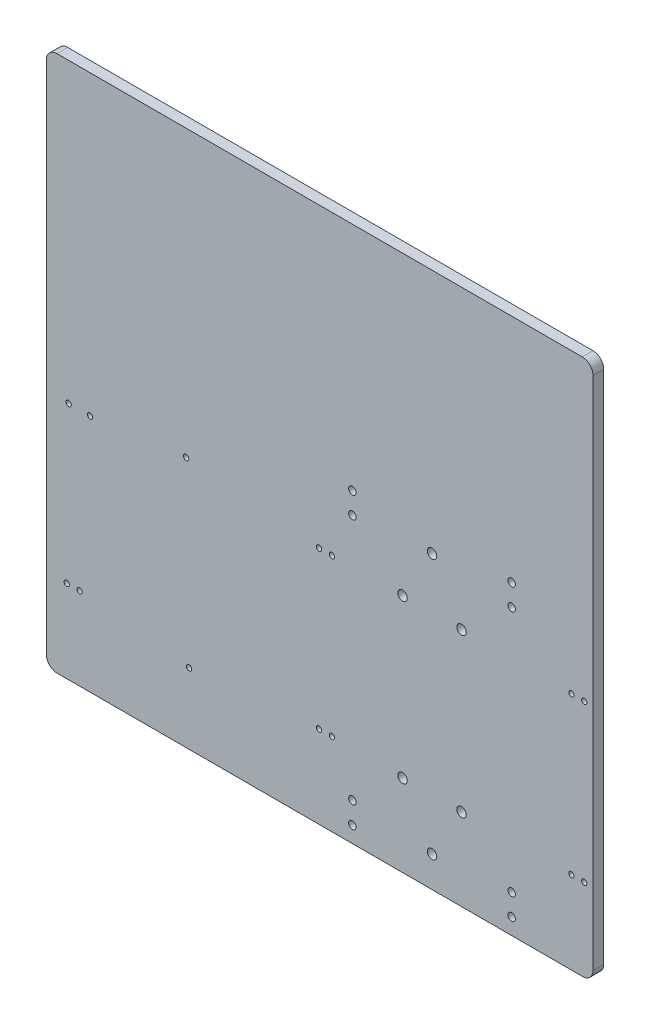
ISO-10303-21;
HEADER;
FILE_DESCRIPTION(('STEP AP214'),'2;1');
FILE_NAME('part.step','',(''),(''),'','','');
FILE_SCHEMA(('AUTOMOTIVE_DESIGN { 1 0 10303 214 1 1 1 1 }'));
ENDSEC;
DATA;
#1=APPLICATION_CONTEXT('core data for automotive mechanical design processes');
#2=APPLICATION_PROTOCOL_DEFINITION('international standard','automotive_design',2000,#1);
#3=PRODUCT_CONTEXT('',#1,'mechanical');
#4=PRODUCT('Part','Part','',(#3));
#5=PRODUCT_RELATED_PRODUCT_CATEGORY('part','',(#4));
#6=PRODUCT_DEFINITION_FORMATION('','',#4);
#7=PRODUCT_DEFINITION_CONTEXT('part definition',#1,'design');
#8=PRODUCT_DEFINITION('design','',#6,#7);
#9=PRODUCT_DEFINITION_SHAPE('','',#8);
#10=(LENGTH_UNIT() NAMED_UNIT(*) SI_UNIT(.MILLI.,.METRE.));
#11=(NAMED_UNIT(*) PLANE_ANGLE_UNIT() SI_UNIT($,.RADIAN.));
#12=(NAMED_UNIT(*) SI_UNIT($,.STERADIAN.) SOLID_ANGLE_UNIT());
#13=UNCERTAINTY_MEASURE_WITH_UNIT(LENGTH_MEASURE(1.E-05),#10,'distance_accuracy_value','');
#14=(GEOMETRIC_REPRESENTATION_CONTEXT(3) GLOBAL_UNCERTAINTY_ASSIGNED_CONTEXT((#13)) GLOBAL_UNIT_ASSIGNED_CONTEXT((#10,
#11,#12)) REPRESENTATION_CONTEXT('',''));
#15=CARTESIAN_POINT('',(0.,0.,0.));
#16=DIRECTION('',(0.,0.,1.));
#17=DIRECTION('',(1.,0.,0.));
#18=AXIS2_PLACEMENT_3D('',#15,#16,#17);
#19=CARTESIAN_POINT('',(50.8,0.,10.));
#20=DIRECTION('',(-1.,0.,0.));
#21=DIRECTION('',(0.,-1.,0.));
#22=AXIS2_PLACEMENT_3D('',#19,#20,#21);
#23=PLANE('',#22);
#24=DIRECTION('',(0.,1.,0.));
#25=VECTOR('',#24,1.);
#26=CARTESIAN_POINT('',(50.8,0.,0.));
#27=LINE('',#26,#25);
#28=CARTESIAN_POINT('',(50.8,9.525,0.));
#29=VERTEX_POINT('',#28);
#30=CARTESIAN_POINT('',(50.8,490.,0.));
#31=VERTEX_POINT('',#30);
#32=EDGE_CURVE('E254',#29,#31,#27,.T.);
#33=ORIENTED_EDGE('',*,*,#32,.T.);
#34=DIRECTION('',(0.,0.,-1.));
#35=VECTOR('',#34,1.);
#36=CARTESIAN_POINT('',(50.8,490.,10.));
#37=LINE('',#36,#35);
#38=CARTESIAN_POINT('',(50.8,490.,10.));
#39=VERTEX_POINT('',#38);
#40=EDGE_CURVE('E401',#31,#39,#37,.F.);
#41=ORIENTED_EDGE('',*,*,#40,.T.);
#42=DIRECTION('',(0.,1.,0.));
#43=VECTOR('',#42,1.);
#44=CARTESIAN_POINT('',(50.8,0.,10.));
#45=LINE('',#44,#43);
#46=CARTESIAN_POINT('',(50.8,9.525,10.));
#47=VERTEX_POINT('',#46);
#48=EDGE_CURVE('E383',#47,#39,#45,.T.);
#49=ORIENTED_EDGE('',*,*,#48,.F.);
#50=DIRECTION('',(0.,0.,-1.));
#51=VECTOR('',#50,1.);
#52=CARTESIAN_POINT('',(50.8,9.525,10.));
#53=LINE('',#52,#51);
#54=EDGE_CURVE('E121',#47,#29,#53,.T.);
#55=ORIENTED_EDGE('',*,*,#54,.T.);
#56=EDGE_LOOP('',(#33,#41,#49,#55));
#57=FACE_BOUND('',#56,.T.);
#58=ADVANCED_FACE('F43',(#57),#23,.F.);
#59=CARTESIAN_POINT('',(-1.11022302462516E-13,500.,10.));
#60=DIRECTION('',(0.,-1.,0.));
#61=DIRECTION('',(1.,0.,0.));
#62=AXIS2_PLACEMENT_3D('',#59,#60,#61);
#63=PLANE('',#62);
#64=DIRECTION('',(-1.,0.,0.));
#65=VECTOR('',#64,1.);
#66=CARTESIAN_POINT('',(-1.11022302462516E-13,500.,10.));
#67=LINE('',#66,#65);
#68=CARTESIAN_POINT('',(40.8,500.,10.));
#69=VERTEX_POINT('',#68);
#70=CARTESIAN_POINT('',(-448.725,500.,10.));
#71=VERTEX_POINT('',#70);
#72=EDGE_CURVE('E139',#69,#71,#67,.T.);
#73=ORIENTED_EDGE('',*,*,#72,.F.);
#74=DIRECTION('',(0.,0.,-1.));
#75=VECTOR('',#74,1.);
#76=CARTESIAN_POINT('',(40.8,500.,10.));
#77=LINE('',#76,#75);
#78=CARTESIAN_POINT('',(40.8,500.,0.));
#79=VERTEX_POINT('',#78);
#80=EDGE_CURVE('E388',#69,#79,#77,.T.);
#81=ORIENTED_EDGE('',*,*,#80,.T.);
#82=DIRECTION('',(-1.,0.,0.));
#83=VECTOR('',#82,1.);
#84=CARTESIAN_POINT('',(-1.11022302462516E-13,500.,0.));
#85=LINE('',#84,#83);
#86=CARTESIAN_POINT('',(-448.725,500.,0.));
#87=VERTEX_POINT('',#86);
#88=EDGE_CURVE('E258',#79,#87,#85,.T.);
#89=ORIENTED_EDGE('',*,*,#88,.T.);
#90=DIRECTION('',(0.,0.,-1.));
#91=VECTOR('',#90,1.);
#92=CARTESIAN_POINT('',(-448.725,500.,10.));
#93=LINE('',#92,#91);
#94=EDGE_CURVE('E120',#87,#71,#93,.F.);
#95=ORIENTED_EDGE('',*,*,#94,.T.);
#96=EDGE_LOOP('',(#73,#81,#89,#95));
#97=FACE_BOUND('',#96,.T.);
#98=ADVANCED_FACE('F434',(#97),#63,.F.);
#99=CARTESIAN_POINT('',(-458.725,0.,10.));
#100=DIRECTION('',(-1.,0.,0.));
#101=DIRECTION('',(0.,-1.,0.));
#102=AXIS2_PLACEMENT_3D('',#99,#100,#101);
#103=PLANE('',#102);
#104=DIRECTION('',(0.,1.,0.));
#105=VECTOR('',#104,1.);
#106=CARTESIAN_POINT('',(-458.725,0.,10.));
#107=LINE('',#106,#105);
#108=CARTESIAN_POINT('',(-458.725,9.99999999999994,10.));
#109=VERTEX_POINT('',#108);
#110=CARTESIAN_POINT('',(-458.725,490.,10.));
#111=VERTEX_POINT('',#110);
#112=EDGE_CURVE('E135',#109,#111,#107,.T.);
#113=ORIENTED_EDGE('',*,*,#112,.T.);
#114=DIRECTION('',(0.,0.,-1.));
#115=VECTOR('',#114,1.);
#116=CARTESIAN_POINT('',(-458.725,490.,0.));
#117=LINE('',#116,#115);
#118=CARTESIAN_POINT('',(-458.725,490.,0.));
#119=VERTEX_POINT('',#118);
#120=EDGE_CURVE('E52',#111,#119,#117,.T.);
#121=ORIENTED_EDGE('',*,*,#120,.T.);
#122=DIRECTION('',(0.,1.,0.));
#123=VECTOR('',#122,1.);
#124=CARTESIAN_POINT('',(-458.725,0.,0.));
#125=LINE('',#124,#123);
#126=CARTESIAN_POINT('',(-458.725,9.99999999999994,0.));
#127=VERTEX_POINT('',#126);
#128=EDGE_CURVE('E262',#127,#119,#125,.T.);
#129=ORIENTED_EDGE('',*,*,#128,.F.);
#130=DIRECTION('',(0.,0.,-1.));
#131=VECTOR('',#130,1.);
#132=CARTESIAN_POINT('',(-458.725,9.99999999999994,10.));
#133=LINE('',#132,#131);
#134=EDGE_CURVE('E411',#127,#109,#133,.F.);
#135=ORIENTED_EDGE('',*,*,#134,.T.);
#136=EDGE_LOOP('',(#113,#121,#129,#135));
#137=FACE_BOUND('',#136,.T.);
#138=ADVANCED_FACE('F419',(#137),#103,.T.);
#139=CARTESIAN_POINT('',(0.,0.,10.));
#140=DIRECTION('',(0.,-1.,0.));
#141=DIRECTION('',(1.,0.,0.));
#142=AXIS2_PLACEMENT_3D('',#139,#140,#141);
#143=PLANE('',#142);
#144=DIRECTION('',(-1.,0.,0.));
#145=VECTOR('',#144,1.);
#146=CARTESIAN_POINT('',(0.,0.,10.));
#147=LINE('',#146,#145);
#148=CARTESIAN_POINT('',(41.275,0.,10.));
#149=VERTEX_POINT('',#148);
#150=CARTESIAN_POINT('',(-448.725,0.,10.));
#151=VERTEX_POINT('',#150);
#152=EDGE_CURVE('E113',#149,#151,#147,.T.);
#153=ORIENTED_EDGE('',*,*,#152,.T.);
#154=DIRECTION('',(0.,0.,-1.));
#155=VECTOR('',#154,1.);
#156=CARTESIAN_POINT('',(-448.725,0.,10.));
#157=LINE('',#156,#155);
#158=CARTESIAN_POINT('',(-448.725,0.,0.));
#159=VERTEX_POINT('',#158);
#160=EDGE_CURVE('E11',#151,#159,#157,.T.);
#161=ORIENTED_EDGE('',*,*,#160,.T.);
#162=DIRECTION('',(-1.,0.,0.));
#163=VECTOR('',#162,1.);
#164=CARTESIAN_POINT('',(0.,0.,0.));
#165=LINE('',#164,#163);
#166=CARTESIAN_POINT('',(41.275,0.,0.));
#167=VERTEX_POINT('',#166);
#168=EDGE_CURVE('E116',#167,#159,#165,.T.);
#169=ORIENTED_EDGE('',*,*,#168,.F.);
#170=DIRECTION('',(0.,0.,-1.));
#171=VECTOR('',#170,1.);
#172=CARTESIAN_POINT('',(41.275,0.,10.));
#173=LINE('',#172,#171);
#174=EDGE_CURVE('E110',#149,#167,#173,.T.);
#175=ORIENTED_EDGE('',*,*,#174,.F.);
#176=EDGE_LOOP('',(#153,#161,#169,#175));
#177=FACE_BOUND('',#176,.T.);
#178=ADVANCED_FACE('F112',(#177),#143,.T.);
#179=CARTESIAN_POINT('',(-173.399999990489,15.000000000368,10.));
#180=DIRECTION('',(0.,0.,-1.));
#181=DIRECTION('',(-1.,0.,0.));
#182=AXIS2_PLACEMENT_3D('',#179,#180,#181);
#183=CYLINDRICAL_SURFACE('',#182,3.49999999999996);
#184=CARTESIAN_POINT('',(-173.399999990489,15.000000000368,10.));
#185=DIRECTION('',(0.,0.,1.));
#186=DIRECTION('',(1.,0.,0.));
#187=AXIS2_PLACEMENT_3D('',#184,#185,#186);
#188=CIRCLE('',#187,3.49999999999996);
#189=CARTESIAN_POINT('',(-169.899999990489,15.000000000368,10.));
#190=VERTEX_POINT('',#189);
#191=EDGE_CURVE('E246',#190,#190,#188,.T.);
#192=ORIENTED_EDGE('',*,*,#191,.T.);
#193=EDGE_LOOP('',(#192));
#194=FACE_BOUND('',#193,.T.);
#195=CARTESIAN_POINT('',(-173.399999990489,15.000000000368,0.));
#196=DIRECTION('',(0.,0.,1.));
#197=DIRECTION('',(1.,0.,0.));
#198=AXIS2_PLACEMENT_3D('',#195,#196,#197);
#199=CIRCLE('',#198,3.49999999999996);
#200=CARTESIAN_POINT('',(-169.899999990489,15.000000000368,0.));
#201=VERTEX_POINT('',#200);
#202=EDGE_CURVE('E375',#201,#201,#199,.T.);
#203=ORIENTED_EDGE('',*,*,#202,.F.);
#204=EDGE_LOOP('',(#203));
#205=FACE_BOUND('',#204,.T.);
#206=ADVANCED_FACE('F504',(#194,#205),#183,.F.);
#207=CARTESIAN_POINT('',(-71.7036934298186,223.62500000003,10.));
#208=DIRECTION('',(0.,0.,-1.));
#209=DIRECTION('',(-1.,0.,0.));
#210=AXIS2_PLACEMENT_3D('',#207,#208,#209);
#211=CYLINDRICAL_SURFACE('',#210,4.40054999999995);
#212=CARTESIAN_POINT('',(-71.7036934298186,223.62500000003,10.));
#213=DIRECTION('',(0.,0.,1.));
#214=DIRECTION('',(1.,0.,0.));
#215=AXIS2_PLACEMENT_3D('',#212,#213,#214);
#216=CIRCLE('',#215,4.40054999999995);
#217=CARTESIAN_POINT('',(-67.3031434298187,223.62500000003,10.));
#218=VERTEX_POINT('',#217);
#219=EDGE_CURVE('E242',#218,#218,#216,.T.);
#220=ORIENTED_EDGE('',*,*,#219,.T.);
#221=EDGE_LOOP('',(#220));
#222=FACE_BOUND('',#221,.T.);
#223=CARTESIAN_POINT('',(-71.7036934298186,223.62500000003,0.));
#224=DIRECTION('',(0.,0.,1.));
#225=DIRECTION('',(1.,0.,0.));
#226=AXIS2_PLACEMENT_3D('',#223,#224,#225);
#227=CIRCLE('',#226,4.40054999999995);
#228=CARTESIAN_POINT('',(-67.3031434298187,223.62500000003,0.));
#229=VERTEX_POINT('',#228);
#230=EDGE_CURVE('E371',#229,#229,#227,.T.);
#231=ORIENTED_EDGE('',*,*,#230,.F.);
#232=EDGE_LOOP('',(#231));
#233=FACE_BOUND('',#232,.T.);
#234=ADVANCED_FACE('F507',(#222,#233),#211,.F.);
#235=CARTESIAN_POINT('',(-99.1999999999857,271.250000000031,10.));
#236=DIRECTION('',(0.,0.,-1.));
#237=DIRECTION('',(-1.,0.,0.));
#238=AXIS2_PLACEMENT_3D('',#235,#236,#237);
#239=CYLINDRICAL_SURFACE('',#238,4.40055);
#240=CARTESIAN_POINT('',(-99.1999999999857,271.250000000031,10.));
#241=DIRECTION('',(0.,0.,1.));
#242=DIRECTION('',(1.,0.,0.));
#243=AXIS2_PLACEMENT_3D('',#240,#241,#242);
#244=CIRCLE('',#243,4.40055);
#245=CARTESIAN_POINT('',(-94.7994499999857,271.250000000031,10.));
#246=VERTEX_POINT('',#245);
#247=EDGE_CURVE('E238',#246,#246,#244,.T.);
#248=ORIENTED_EDGE('',*,*,#247,.T.);
#249=EDGE_LOOP('',(#248));
#250=FACE_BOUND('',#249,.T.);
#251=CARTESIAN_POINT('',(-99.1999999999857,271.250000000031,0.));
#252=DIRECTION('',(0.,0.,1.));
#253=DIRECTION('',(1.,0.,0.));
#254=AXIS2_PLACEMENT_3D('',#251,#252,#253);
#255=CIRCLE('',#254,4.40055);
#256=CARTESIAN_POINT('',(-94.7994499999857,271.250000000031,0.));
#257=VERTEX_POINT('',#256);
#258=EDGE_CURVE('E367',#257,#257,#255,.T.);
#259=ORIENTED_EDGE('',*,*,#258,.F.);
#260=EDGE_LOOP('',(#259));
#261=FACE_BOUND('',#260,.T.);
#262=ADVANCED_FACE('F511',(#250,#261),#239,.F.);
#263=CARTESIAN_POINT('',(-126.696306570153,223.625000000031,10.));
#264=DIRECTION('',(0.,0.,-1.));
#265=DIRECTION('',(-1.,0.,0.));
#266=AXIS2_PLACEMENT_3D('',#263,#264,#265);
#267=CYLINDRICAL_SURFACE('',#266,4.40054999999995);
#268=CARTESIAN_POINT('',(-126.696306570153,223.625000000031,10.));
#269=DIRECTION('',(0.,0.,1.));
#270=DIRECTION('',(1.,0.,0.));
#271=AXIS2_PLACEMENT_3D('',#268,#269,#270);
#272=CIRCLE('',#271,4.40054999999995);
#273=CARTESIAN_POINT('',(-122.295756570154,223.625000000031,10.));
#274=VERTEX_POINT('',#273);
#275=EDGE_CURVE('E234',#274,#274,#272,.T.);
#276=ORIENTED_EDGE('',*,*,#275,.T.);
#277=EDGE_LOOP('',(#276));
#278=FACE_BOUND('',#277,.T.);
#279=CARTESIAN_POINT('',(-126.696306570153,223.625000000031,0.));
#280=DIRECTION('',(0.,0.,1.));
#281=DIRECTION('',(1.,0.,0.));
#282=AXIS2_PLACEMENT_3D('',#279,#280,#281);
#283=CIRCLE('',#282,4.40054999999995);
#284=CARTESIAN_POINT('',(-122.295756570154,223.625000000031,0.));
#285=VERTEX_POINT('',#284);
#286=EDGE_CURVE('E363',#285,#285,#283,.T.);
#287=ORIENTED_EDGE('',*,*,#286,.F.);
#288=EDGE_LOOP('',(#287));
#289=FACE_BOUND('',#288,.T.);
#290=ADVANCED_FACE('F515',(#278,#289),#267,.F.);
#291=CARTESIAN_POINT('',(-71.7036934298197,76.3750000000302,10.));
#292=DIRECTION('',(0.,0.,-1.));
#293=DIRECTION('',(-1.,0.,0.));
#294=AXIS2_PLACEMENT_3D('',#291,#292,#293);
#295=CYLINDRICAL_SURFACE('',#294,4.40054999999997);
#296=CARTESIAN_POINT('',(-71.7036934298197,76.3750000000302,10.));
#297=DIRECTION('',(0.,0.,1.));
#298=DIRECTION('',(1.,0.,0.));
#299=AXIS2_PLACEMENT_3D('',#296,#297,#298);
#300=CIRCLE('',#299,4.40054999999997);
#301=CARTESIAN_POINT('',(-67.3031434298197,76.3750000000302,10.));
#302=VERTEX_POINT('',#301);
#303=EDGE_CURVE('E230',#302,#302,#300,.T.);
#304=ORIENTED_EDGE('',*,*,#303,.T.);
#305=EDGE_LOOP('',(#304));
#306=FACE_BOUND('',#305,.T.);
#307=CARTESIAN_POINT('',(-71.7036934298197,76.3750000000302,0.));
#308=DIRECTION('',(0.,0.,1.));
#309=DIRECTION('',(1.,0.,0.));
#310=AXIS2_PLACEMENT_3D('',#307,#308,#309);
#311=CIRCLE('',#310,4.40054999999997);
#312=CARTESIAN_POINT('',(-67.3031434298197,76.3750000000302,0.));
#313=VERTEX_POINT('',#312);
#314=EDGE_CURVE('E359',#313,#313,#311,.T.);
#315=ORIENTED_EDGE('',*,*,#314,.F.);
#316=EDGE_LOOP('',(#315));
#317=FACE_BOUND('',#316,.T.);
#318=ADVANCED_FACE('F519',(#306,#317),#295,.F.);
#319=CARTESIAN_POINT('',(-99.1999999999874,28.7500000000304,10.));
#320=DIRECTION('',(0.,0.,-1.));
#321=DIRECTION('',(-1.,0.,0.));
#322=AXIS2_PLACEMENT_3D('',#319,#320,#321);
#323=CYLINDRICAL_SURFACE('',#322,4.40055);
#324=CARTESIAN_POINT('',(-99.1999999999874,28.7500000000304,10.));
#325=DIRECTION('',(0.,0.,1.));
#326=DIRECTION('',(1.,0.,0.));
#327=AXIS2_PLACEMENT_3D('',#324,#325,#326);
#328=CIRCLE('',#327,4.40055);
#329=CARTESIAN_POINT('',(-94.7994499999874,28.7500000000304,10.));
#330=VERTEX_POINT('',#329);
#331=EDGE_CURVE('E226',#330,#330,#328,.T.);
#332=ORIENTED_EDGE('',*,*,#331,.T.);
#333=EDGE_LOOP('',(#332));
#334=FACE_BOUND('',#333,.T.);
#335=CARTESIAN_POINT('',(-99.1999999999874,28.7500000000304,0.));
#336=DIRECTION('',(0.,0.,1.));
#337=DIRECTION('',(1.,0.,0.));
#338=AXIS2_PLACEMENT_3D('',#335,#336,#337);
#339=CIRCLE('',#338,4.40055);
#340=CARTESIAN_POINT('',(-94.7994499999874,28.7500000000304,0.));
#341=VERTEX_POINT('',#340);
#342=EDGE_CURVE('E355',#341,#341,#339,.T.);
#343=ORIENTED_EDGE('',*,*,#342,.F.);
#344=EDGE_LOOP('',(#343));
#345=FACE_BOUND('',#344,.T.);
#346=ADVANCED_FACE('F523',(#334,#345),#323,.F.);
#347=CARTESIAN_POINT('',(-126.696306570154,76.3750000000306,10.));
#348=DIRECTION('',(0.,0.,-1.));
#349=DIRECTION('',(-1.,0.,0.));
#350=AXIS2_PLACEMENT_3D('',#347,#348,#349);
#351=CYLINDRICAL_SURFACE('',#350,4.40054999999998);
#352=CARTESIAN_POINT('',(-126.696306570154,76.3750000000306,10.));
#353=DIRECTION('',(0.,0.,1.));
#354=DIRECTION('',(1.,0.,0.));
#355=AXIS2_PLACEMENT_3D('',#352,#353,#354);
#356=CIRCLE('',#355,4.40054999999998);
#357=CARTESIAN_POINT('',(-122.295756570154,76.3750000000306,10.));
#358=VERTEX_POINT('',#357);
#359=EDGE_CURVE('E222',#358,#358,#356,.T.);
#360=ORIENTED_EDGE('',*,*,#359,.T.);
#361=EDGE_LOOP('',(#360));
#362=FACE_BOUND('',#361,.T.);
#363=CARTESIAN_POINT('',(-126.696306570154,76.3750000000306,0.));
#364=DIRECTION('',(0.,0.,1.));
#365=DIRECTION('',(1.,0.,0.));
#366=AXIS2_PLACEMENT_3D('',#363,#364,#365);
#367=CIRCLE('',#366,4.40054999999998);
#368=CARTESIAN_POINT('',(-122.295756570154,76.3750000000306,0.));
#369=VERTEX_POINT('',#368);
#370=EDGE_CURVE('E351',#369,#369,#367,.T.);
#371=ORIENTED_EDGE('',*,*,#370,.F.);
#372=EDGE_LOOP('',(#371));
#373=FACE_BOUND('',#372,.T.);
#374=ADVANCED_FACE('F527',(#362,#373),#351,.F.);
#375=CARTESIAN_POINT('',(-25.0000000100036,15.000000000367,10.));
#376=DIRECTION('',(0.,0.,-1.));
#377=DIRECTION('',(-1.,0.,0.));
#378=AXIS2_PLACEMENT_3D('',#375,#376,#377);
#379=CYLINDRICAL_SURFACE('',#378,3.5);
#380=CARTESIAN_POINT('',(-25.0000000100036,15.000000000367,10.));
#381=DIRECTION('',(0.,0.,1.));
#382=DIRECTION('',(1.,0.,0.));
#383=AXIS2_PLACEMENT_3D('',#380,#381,#382);
#384=CIRCLE('',#383,3.5);
#385=CARTESIAN_POINT('',(-21.5000000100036,15.000000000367,10.));
#386=VERTEX_POINT('',#385);
#387=EDGE_CURVE('E218',#386,#386,#384,.T.);
#388=ORIENTED_EDGE('',*,*,#387,.T.);
#389=EDGE_LOOP('',(#388));
#390=FACE_BOUND('',#389,.T.);
#391=CARTESIAN_POINT('',(-25.0000000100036,15.000000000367,0.));
#392=DIRECTION('',(0.,0.,1.));
#393=DIRECTION('',(1.,0.,0.));
#394=AXIS2_PLACEMENT_3D('',#391,#392,#393);
#395=CIRCLE('',#394,3.5);
#396=CARTESIAN_POINT('',(-21.5000000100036,15.000000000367,0.));
#397=VERTEX_POINT('',#396);
#398=EDGE_CURVE('E347',#397,#397,#395,.T.);
#399=ORIENTED_EDGE('',*,*,#398,.F.);
#400=EDGE_LOOP('',(#399));
#401=FACE_BOUND('',#400,.T.);
#402=ADVANCED_FACE('F531',(#390,#401),#379,.F.);
#403=CARTESIAN_POINT('',(-25.0000000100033,35.000000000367,10.));
#404=DIRECTION('',(0.,0.,-1.));
#405=DIRECTION('',(-1.,0.,0.));
#406=AXIS2_PLACEMENT_3D('',#403,#404,#405);
#407=CYLINDRICAL_SURFACE('',#406,3.5);
#408=CARTESIAN_POINT('',(-25.0000000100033,35.000000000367,10.));
#409=DIRECTION('',(0.,0.,1.));
#410=DIRECTION('',(1.,0.,0.));
#411=AXIS2_PLACEMENT_3D('',#408,#409,#410);
#412=CIRCLE('',#411,3.5);
#413=CARTESIAN_POINT('',(-21.5000000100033,35.000000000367,10.));
#414=VERTEX_POINT('',#413);
#415=EDGE_CURVE('E214',#414,#414,#412,.T.);
#416=ORIENTED_EDGE('',*,*,#415,.T.);
#417=EDGE_LOOP('',(#416));
#418=FACE_BOUND('',#417,.T.);
#419=CARTESIAN_POINT('',(-25.0000000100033,35.000000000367,0.));
#420=DIRECTION('',(0.,0.,1.));
#421=DIRECTION('',(1.,0.,0.));
#422=AXIS2_PLACEMENT_3D('',#419,#420,#421);
#423=CIRCLE('',#422,3.5);
#424=CARTESIAN_POINT('',(-21.5000000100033,35.000000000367,0.));
#425=VERTEX_POINT('',#424);
#426=EDGE_CURVE('E343',#425,#425,#423,.T.);
#427=ORIENTED_EDGE('',*,*,#426,.F.);
#428=EDGE_LOOP('',(#427));
#429=FACE_BOUND('',#428,.T.);
#430=ADVANCED_FACE('F535',(#418,#429),#407,.F.);
#431=CARTESIAN_POINT('',(-173.399999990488,264.999999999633,10.));
#432=DIRECTION('',(0.,0.,-1.));
#433=DIRECTION('',(-1.,0.,0.));
#434=AXIS2_PLACEMENT_3D('',#431,#432,#433);
#435=CYLINDRICAL_SURFACE('',#434,3.49999999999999);
#436=CARTESIAN_POINT('',(-173.399999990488,264.999999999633,10.));
#437=DIRECTION('',(0.,0.,1.));
#438=DIRECTION('',(1.,0.,0.));
#439=AXIS2_PLACEMENT_3D('',#436,#437,#438);
#440=CIRCLE('',#439,3.49999999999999);
#441=CARTESIAN_POINT('',(-169.899999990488,264.999999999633,10.));
#442=VERTEX_POINT('',#441);
#443=EDGE_CURVE('E210',#442,#442,#440,.T.);
#444=ORIENTED_EDGE('',*,*,#443,.T.);
#445=EDGE_LOOP('',(#444));
#446=FACE_BOUND('',#445,.T.);
#447=CARTESIAN_POINT('',(-173.399999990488,264.999999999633,0.));
#448=DIRECTION('',(0.,0.,1.));
#449=DIRECTION('',(1.,0.,0.));
#450=AXIS2_PLACEMENT_3D('',#447,#448,#449);
#451=CIRCLE('',#450,3.49999999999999);
#452=CARTESIAN_POINT('',(-169.899999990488,264.999999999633,0.));
#453=VERTEX_POINT('',#452);
#454=EDGE_CURVE('E339',#453,#453,#451,.T.);
#455=ORIENTED_EDGE('',*,*,#454,.F.);
#456=EDGE_LOOP('',(#455));
#457=FACE_BOUND('',#456,.T.);
#458=ADVANCED_FACE('F539',(#446,#457),#435,.F.);
#459=CARTESIAN_POINT('',(-173.399999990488,284.999999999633,10.));
#460=DIRECTION('',(0.,0.,-1.));
#461=DIRECTION('',(-1.,0.,0.));
#462=AXIS2_PLACEMENT_3D('',#459,#460,#461);
#463=CYLINDRICAL_SURFACE('',#462,3.49999999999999);
#464=CARTESIAN_POINT('',(-173.399999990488,284.999999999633,10.));
#465=DIRECTION('',(0.,0.,1.));
#466=DIRECTION('',(1.,0.,0.));
#467=AXIS2_PLACEMENT_3D('',#464,#465,#466);
#468=CIRCLE('',#467,3.49999999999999);
#469=CARTESIAN_POINT('',(-169.899999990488,284.999999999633,10.));
#470=VERTEX_POINT('',#469);
#471=EDGE_CURVE('E206',#470,#470,#468,.T.);
#472=ORIENTED_EDGE('',*,*,#471,.T.);
#473=EDGE_LOOP('',(#472));
#474=FACE_BOUND('',#473,.T.);
#475=CARTESIAN_POINT('',(-173.399999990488,284.999999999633,0.));
#476=DIRECTION('',(0.,0.,1.));
#477=DIRECTION('',(1.,0.,0.));
#478=AXIS2_PLACEMENT_3D('',#475,#476,#477);
#479=CIRCLE('',#478,3.49999999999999);
#480=CARTESIAN_POINT('',(-169.899999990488,284.999999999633,0.));
#481=VERTEX_POINT('',#480);
#482=EDGE_CURVE('E335',#481,#481,#479,.T.);
#483=ORIENTED_EDGE('',*,*,#482,.F.);
#484=EDGE_LOOP('',(#483));
#485=FACE_BOUND('',#484,.T.);
#486=ADVANCED_FACE('F543',(#474,#485),#463,.F.);
#487=CARTESIAN_POINT('',(-437.93088623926,223.00000004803,10.));
#488=DIRECTION('',(0.,0.,-1.));
#489=DIRECTION('',(-1.,0.,0.));
#490=AXIS2_PLACEMENT_3D('',#487,#488,#489);
#491=CYLINDRICAL_SURFACE('',#490,2.48920000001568);
#492=CARTESIAN_POINT('',(-437.93088623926,223.00000004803,10.));
#493=DIRECTION('',(0.,0.,1.));
#494=DIRECTION('',(1.,0.,0.));
#495=AXIS2_PLACEMENT_3D('',#492,#493,#494);
#496=CIRCLE('',#495,2.48920000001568);
#497=CARTESIAN_POINT('',(-435.441686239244,223.00000004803,10.));
#498=VERTEX_POINT('',#497);
#499=EDGE_CURVE('E202',#498,#498,#496,.T.);
#500=ORIENTED_EDGE('',*,*,#499,.T.);
#501=EDGE_LOOP('',(#500));
#502=FACE_BOUND('',#501,.T.);
#503=CARTESIAN_POINT('',(-437.93088623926,223.00000004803,0.));
#504=DIRECTION('',(0.,0.,1.));
#505=DIRECTION('',(1.,0.,0.));
#506=AXIS2_PLACEMENT_3D('',#503,#504,#505);
#507=CIRCLE('',#506,2.48920000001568);
#508=CARTESIAN_POINT('',(-435.441686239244,223.00000004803,0.));
#509=VERTEX_POINT('',#508);
#510=EDGE_CURVE('E331',#509,#509,#507,.T.);
#511=ORIENTED_EDGE('',*,*,#510,.F.);
#512=EDGE_LOOP('',(#511));
#513=FACE_BOUND('',#512,.T.);
#514=ADVANCED_FACE('F547',(#502,#513),#491,.F.);
#515=CARTESIAN_POINT('',(-417.93088623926,223.00000004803,10.));
#516=DIRECTION('',(0.,0.,-1.));
#517=DIRECTION('',(-1.,0.,0.));
#518=AXIS2_PLACEMENT_3D('',#515,#516,#517);
#519=CYLINDRICAL_SURFACE('',#518,2.48920000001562);
#520=CARTESIAN_POINT('',(-417.93088623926,223.00000004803,10.));
#521=DIRECTION('',(0.,0.,1.));
#522=DIRECTION('',(1.,0.,0.));
#523=AXIS2_PLACEMENT_3D('',#520,#521,#522);
#524=CIRCLE('',#523,2.48920000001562);
#525=CARTESIAN_POINT('',(-415.441686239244,223.00000004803,10.));
#526=VERTEX_POINT('',#525);
#527=EDGE_CURVE('E198',#526,#526,#524,.T.);
#528=ORIENTED_EDGE('',*,*,#527,.T.);
#529=EDGE_LOOP('',(#528));
#530=FACE_BOUND('',#529,.T.);
#531=CARTESIAN_POINT('',(-417.93088623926,223.00000004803,0.));
#532=DIRECTION('',(0.,0.,1.));
#533=DIRECTION('',(1.,0.,0.));
#534=AXIS2_PLACEMENT_3D('',#531,#532,#533);
#535=CIRCLE('',#534,2.48920000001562);
#536=CARTESIAN_POINT('',(-415.441686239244,223.00000004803,0.));
#537=VERTEX_POINT('',#536);
#538=EDGE_CURVE('E327',#537,#537,#535,.T.);
#539=ORIENTED_EDGE('',*,*,#538,.F.);
#540=EDGE_LOOP('',(#539));
#541=FACE_BOUND('',#540,.T.);
#542=ADVANCED_FACE('F551',(#530,#541),#519,.F.);
#543=CARTESIAN_POINT('',(-439.725,76.9999999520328,10.));
#544=DIRECTION('',(0.,0.,-1.));
#545=DIRECTION('',(-1.,0.,0.));
#546=AXIS2_PLACEMENT_3D('',#543,#544,#545);
#547=CYLINDRICAL_SURFACE('',#546,2.48920000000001);
#548=CARTESIAN_POINT('',(-439.725,76.9999999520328,10.));
#549=DIRECTION('',(0.,0.,1.));
#550=DIRECTION('',(1.,0.,0.));
#551=AXIS2_PLACEMENT_3D('',#548,#549,#550);
#552=CIRCLE('',#551,2.48920000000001);
#553=CARTESIAN_POINT('',(-437.2358,76.9999999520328,10.));
#554=VERTEX_POINT('',#553);
#555=EDGE_CURVE('E194',#554,#554,#552,.T.);
#556=ORIENTED_EDGE('',*,*,#555,.T.);
#557=EDGE_LOOP('',(#556));
#558=FACE_BOUND('',#557,.T.);
#559=CARTESIAN_POINT('',(-439.725,76.9999999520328,0.));
#560=DIRECTION('',(0.,0.,1.));
#561=DIRECTION('',(1.,0.,0.));
#562=AXIS2_PLACEMENT_3D('',#559,#560,#561);
#563=CIRCLE('',#562,2.48920000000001);
#564=CARTESIAN_POINT('',(-437.2358,76.9999999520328,0.));
#565=VERTEX_POINT('',#564);
#566=EDGE_CURVE('E323',#565,#565,#563,.T.);
#567=ORIENTED_EDGE('',*,*,#566,.F.);
#568=EDGE_LOOP('',(#567));
#569=FACE_BOUND('',#568,.T.);
#570=ADVANCED_FACE('F555',(#558,#569),#547,.F.);
#571=CARTESIAN_POINT('',(-427.725,76.9999999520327,10.));
#572=DIRECTION('',(0.,0.,-1.));
#573=DIRECTION('',(-1.,0.,0.));
#574=AXIS2_PLACEMENT_3D('',#571,#572,#573);
#575=CYLINDRICAL_SURFACE('',#574,2.47649999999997);
#576=CARTESIAN_POINT('',(-427.725,76.9999999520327,10.));
#577=DIRECTION('',(0.,0.,1.));
#578=DIRECTION('',(1.,0.,0.));
#579=AXIS2_PLACEMENT_3D('',#576,#577,#578);
#580=CIRCLE('',#579,2.47649999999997);
#581=CARTESIAN_POINT('',(-425.2485,76.9999999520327,10.));
#582=VERTEX_POINT('',#581);
#583=EDGE_CURVE('E190',#582,#582,#580,.T.);
#584=ORIENTED_EDGE('',*,*,#583,.T.);
#585=EDGE_LOOP('',(#584));
#586=FACE_BOUND('',#585,.T.);
#587=CARTESIAN_POINT('',(-427.725,76.9999999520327,0.));
#588=DIRECTION('',(0.,0.,1.));
#589=DIRECTION('',(1.,0.,0.));
#590=AXIS2_PLACEMENT_3D('',#587,#588,#589);
#591=CIRCLE('',#590,2.47649999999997);
#592=CARTESIAN_POINT('',(-425.2485,76.9999999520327,0.));
#593=VERTEX_POINT('',#592);
#594=EDGE_CURVE('E319',#593,#593,#591,.T.);
#595=ORIENTED_EDGE('',*,*,#594,.F.);
#596=EDGE_LOOP('',(#595));
#597=FACE_BOUND('',#596,.T.);
#598=ADVANCED_FACE('F559',(#586,#597),#575,.F.);
#599=CARTESIAN_POINT('',(-204.50625,223.000000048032,10.));
#600=DIRECTION('',(0.,0.,-1.));
#601=DIRECTION('',(-1.,0.,0.));
#602=AXIS2_PLACEMENT_3D('',#599,#600,#601);
#603=CYLINDRICAL_SURFACE('',#602,2.47650000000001);
#604=CARTESIAN_POINT('',(-204.50625,223.000000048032,10.));
#605=DIRECTION('',(0.,0.,1.));
#606=DIRECTION('',(1.,0.,0.));
#607=AXIS2_PLACEMENT_3D('',#604,#605,#606);
#608=CIRCLE('',#607,2.47650000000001);
#609=CARTESIAN_POINT('',(-202.02975,223.000000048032,10.));
#610=VERTEX_POINT('',#609);
#611=EDGE_CURVE('E186',#610,#610,#608,.T.);
#612=ORIENTED_EDGE('',*,*,#611,.T.);
#613=EDGE_LOOP('',(#612));
#614=FACE_BOUND('',#613,.T.);
#615=CARTESIAN_POINT('',(-204.50625,223.000000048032,0.));
#616=DIRECTION('',(0.,0.,1.));
#617=DIRECTION('',(1.,0.,0.));
#618=AXIS2_PLACEMENT_3D('',#615,#616,#617);
#619=CIRCLE('',#618,2.47650000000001);
#620=CARTESIAN_POINT('',(-202.02975,223.000000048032,0.));
#621=VERTEX_POINT('',#620);
#622=EDGE_CURVE('E315',#621,#621,#619,.T.);
#623=ORIENTED_EDGE('',*,*,#622,.F.);
#624=EDGE_LOOP('',(#623));
#625=FACE_BOUND('',#624,.T.);
#626=ADVANCED_FACE('F563',(#614,#625),#603,.F.);
#627=CARTESIAN_POINT('',(-192.50625,223.000000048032,10.));
#628=DIRECTION('',(0.,0.,-1.));
#629=DIRECTION('',(-1.,0.,0.));
#630=AXIS2_PLACEMENT_3D('',#627,#628,#629);
#631=CYLINDRICAL_SURFACE('',#630,2.48920000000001);
#632=CARTESIAN_POINT('',(-192.50625,223.000000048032,10.));
#633=DIRECTION('',(0.,0.,1.));
#634=DIRECTION('',(1.,0.,0.));
#635=AXIS2_PLACEMENT_3D('',#632,#633,#634);
#636=CIRCLE('',#635,2.48920000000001);
#637=CARTESIAN_POINT('',(-190.01705,223.000000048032,10.));
#638=VERTEX_POINT('',#637);
#639=EDGE_CURVE('E182',#638,#638,#636,.T.);
#640=ORIENTED_EDGE('',*,*,#639,.T.);
#641=EDGE_LOOP('',(#640));
#642=FACE_BOUND('',#641,.T.);
#643=CARTESIAN_POINT('',(-192.50625,223.000000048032,0.));
#644=DIRECTION('',(0.,0.,1.));
#645=DIRECTION('',(1.,0.,0.));
#646=AXIS2_PLACEMENT_3D('',#643,#644,#645);
#647=CIRCLE('',#646,2.48920000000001);
#648=CARTESIAN_POINT('',(-190.01705,223.000000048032,0.));
#649=VERTEX_POINT('',#648);
#650=EDGE_CURVE('E311',#649,#649,#647,.T.);
#651=ORIENTED_EDGE('',*,*,#650,.F.);
#652=EDGE_LOOP('',(#651));
#653=FACE_BOUND('',#652,.T.);
#654=ADVANCED_FACE('F567',(#642,#653),#631,.F.);
#655=CARTESIAN_POINT('',(-204.506250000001,76.99999995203,10.));
#656=DIRECTION('',(0.,0.,-1.));
#657=DIRECTION('',(-1.,0.,0.));
#658=AXIS2_PLACEMENT_3D('',#655,#656,#657);
#659=CYLINDRICAL_SURFACE('',#658,2.4892);
#660=CARTESIAN_POINT('',(-204.506250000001,76.99999995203,10.));
#661=DIRECTION('',(0.,0.,1.));
#662=DIRECTION('',(1.,0.,0.));
#663=AXIS2_PLACEMENT_3D('',#660,#661,#662);
#664=CIRCLE('',#663,2.4892);
#665=CARTESIAN_POINT('',(-202.017050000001,76.99999995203,10.));
#666=VERTEX_POINT('',#665);
#667=EDGE_CURVE('E178',#666,#666,#664,.T.);
#668=ORIENTED_EDGE('',*,*,#667,.T.);
#669=EDGE_LOOP('',(#668));
#670=FACE_BOUND('',#669,.T.);
#671=CARTESIAN_POINT('',(-204.506250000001,76.99999995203,0.));
#672=DIRECTION('',(0.,0.,1.));
#673=DIRECTION('',(1.,0.,0.));
#674=AXIS2_PLACEMENT_3D('',#671,#672,#673);
#675=CIRCLE('',#674,2.4892);
#676=CARTESIAN_POINT('',(-202.017050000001,76.99999995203,0.));
#677=VERTEX_POINT('',#676);
#678=EDGE_CURVE('E307',#677,#677,#675,.T.);
#679=ORIENTED_EDGE('',*,*,#678,.F.);
#680=EDGE_LOOP('',(#679));
#681=FACE_BOUND('',#680,.T.);
#682=ADVANCED_FACE('F571',(#670,#681),#659,.F.);
#683=CARTESIAN_POINT('',(-192.506250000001,76.9999999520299,10.));
#684=DIRECTION('',(0.,0.,-1.));
#685=DIRECTION('',(-1.,0.,0.));
#686=AXIS2_PLACEMENT_3D('',#683,#684,#685);
#687=CYLINDRICAL_SURFACE('',#686,2.47650000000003);
#688=CARTESIAN_POINT('',(-192.506250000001,76.9999999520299,10.));
#689=DIRECTION('',(0.,0.,1.));
#690=DIRECTION('',(1.,0.,0.));
#691=AXIS2_PLACEMENT_3D('',#688,#689,#690);
#692=CIRCLE('',#691,2.47650000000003);
#693=CARTESIAN_POINT('',(-190.029750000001,76.9999999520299,10.));
#694=VERTEX_POINT('',#693);
#695=EDGE_CURVE('E174',#694,#694,#692,.T.);
#696=ORIENTED_EDGE('',*,*,#695,.T.);
#697=EDGE_LOOP('',(#696));
#698=FACE_BOUND('',#697,.T.);
#699=CARTESIAN_POINT('',(-192.506250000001,76.9999999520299,0.));
#700=DIRECTION('',(0.,0.,1.));
#701=DIRECTION('',(1.,0.,0.));
#702=AXIS2_PLACEMENT_3D('',#699,#700,#701);
#703=CIRCLE('',#702,2.47650000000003);
#704=CARTESIAN_POINT('',(-190.029750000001,76.9999999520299,0.));
#705=VERTEX_POINT('',#704);
#706=EDGE_CURVE('E303',#705,#705,#703,.T.);
#707=ORIENTED_EDGE('',*,*,#706,.F.);
#708=EDGE_LOOP('',(#707));
#709=FACE_BOUND('',#708,.T.);
#710=ADVANCED_FACE('F575',(#698,#709),#687,.F.);
#711=CARTESIAN_POINT('',(-325.652282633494,65.79999999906,10.));
#712=DIRECTION('',(0.,0.,-1.));
#713=DIRECTION('',(-1.,0.,0.));
#714=AXIS2_PLACEMENT_3D('',#711,#712,#713);
#715=CYLINDRICAL_SURFACE('',#714,2.48920000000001);
#716=CARTESIAN_POINT('',(-325.652282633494,65.79999999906,10.));
#717=DIRECTION('',(0.,0.,1.));
#718=DIRECTION('',(1.,0.,0.));
#719=AXIS2_PLACEMENT_3D('',#716,#717,#718);
#720=CIRCLE('',#719,2.48920000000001);
#721=CARTESIAN_POINT('',(-323.163082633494,65.79999999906,10.));
#722=VERTEX_POINT('',#721);
#723=EDGE_CURVE('E170',#722,#722,#720,.T.);
#724=ORIENTED_EDGE('',*,*,#723,.T.);
#725=EDGE_LOOP('',(#724));
#726=FACE_BOUND('',#725,.T.);
#727=CARTESIAN_POINT('',(-325.652282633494,65.79999999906,0.));
#728=DIRECTION('',(0.,0.,1.));
#729=DIRECTION('',(1.,0.,0.));
#730=AXIS2_PLACEMENT_3D('',#727,#728,#729);
#731=CIRCLE('',#730,2.48920000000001);
#732=CARTESIAN_POINT('',(-323.163082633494,65.79999999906,0.));
#733=VERTEX_POINT('',#732);
#734=EDGE_CURVE('E299',#733,#733,#731,.T.);
#735=ORIENTED_EDGE('',*,*,#734,.F.);
#736=EDGE_LOOP('',(#735));
#737=FACE_BOUND('',#736,.T.);
#738=ADVANCED_FACE('F579',(#726,#737),#715,.F.);
#739=CARTESIAN_POINT('',(30.7124999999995,76.9999999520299,10.));
#740=DIRECTION('',(0.,0.,-1.));
#741=DIRECTION('',(-1.,0.,0.));
#742=AXIS2_PLACEMENT_3D('',#739,#740,#741);
#743=CYLINDRICAL_SURFACE('',#742,2.4892);
#744=CARTESIAN_POINT('',(30.7124999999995,76.9999999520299,10.));
#745=DIRECTION('',(0.,0.,1.));
#746=DIRECTION('',(1.,0.,0.));
#747=AXIS2_PLACEMENT_3D('',#744,#745,#746);
#748=CIRCLE('',#747,2.4892);
#749=CARTESIAN_POINT('',(33.2016999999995,76.9999999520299,10.));
#750=VERTEX_POINT('',#749);
#751=EDGE_CURVE('E166',#750,#750,#748,.T.);
#752=ORIENTED_EDGE('',*,*,#751,.T.);
#753=EDGE_LOOP('',(#752));
#754=FACE_BOUND('',#753,.T.);
#755=CARTESIAN_POINT('',(30.7124999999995,76.9999999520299,0.));
#756=DIRECTION('',(0.,0.,1.));
#757=DIRECTION('',(1.,0.,0.));
#758=AXIS2_PLACEMENT_3D('',#755,#756,#757);
#759=CIRCLE('',#758,2.4892);
#760=CARTESIAN_POINT('',(33.2016999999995,76.9999999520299,0.));
#761=VERTEX_POINT('',#760);
#762=EDGE_CURVE('E295',#761,#761,#759,.T.);
#763=ORIENTED_EDGE('',*,*,#762,.F.);
#764=EDGE_LOOP('',(#763));
#765=FACE_BOUND('',#764,.T.);
#766=ADVANCED_FACE('F583',(#754,#765),#743,.F.);
#767=CARTESIAN_POINT('',(42.7125000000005,223.00000004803,10.));
#768=DIRECTION('',(0.,0.,-1.));
#769=DIRECTION('',(-1.,0.,0.));
#770=AXIS2_PLACEMENT_3D('',#767,#768,#769);
#771=CYLINDRICAL_SURFACE('',#770,2.4892);
#772=CARTESIAN_POINT('',(42.7125000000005,223.00000004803,10.));
#773=DIRECTION('',(0.,0.,1.));
#774=DIRECTION('',(1.,0.,0.));
#775=AXIS2_PLACEMENT_3D('',#772,#773,#774);
#776=CIRCLE('',#775,2.4892);
#777=CARTESIAN_POINT('',(45.2017000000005,223.00000004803,10.));
#778=VERTEX_POINT('',#777);
#779=EDGE_CURVE('E162',#778,#778,#776,.T.);
#780=ORIENTED_EDGE('',*,*,#779,.T.);
#781=EDGE_LOOP('',(#780));
#782=FACE_BOUND('',#781,.T.);
#783=CARTESIAN_POINT('',(42.7125000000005,223.00000004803,0.));
#784=DIRECTION('',(0.,0.,1.));
#785=DIRECTION('',(1.,0.,0.));
#786=AXIS2_PLACEMENT_3D('',#783,#784,#785);
#787=CIRCLE('',#786,2.4892);
#788=CARTESIAN_POINT('',(45.2017000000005,223.00000004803,0.));
#789=VERTEX_POINT('',#788);
#790=EDGE_CURVE('E291',#789,#789,#787,.T.);
#791=ORIENTED_EDGE('',*,*,#790,.F.);
#792=EDGE_LOOP('',(#791));
#793=FACE_BOUND('',#792,.T.);
#794=ADVANCED_FACE('F587',(#782,#793),#771,.F.);
#795=CARTESIAN_POINT('',(30.7125000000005,223.00000004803,10.));
#796=DIRECTION('',(0.,0.,-1.));
#797=DIRECTION('',(-1.,0.,0.));
#798=AXIS2_PLACEMENT_3D('',#795,#796,#797);
#799=CYLINDRICAL_SURFACE('',#798,2.47650000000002);
#800=CARTESIAN_POINT('',(30.7125000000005,223.00000004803,10.));
#801=DIRECTION('',(0.,0.,1.));
#802=DIRECTION('',(1.,0.,0.));
#803=AXIS2_PLACEMENT_3D('',#800,#801,#802);
#804=CIRCLE('',#803,2.47650000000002);
#805=CARTESIAN_POINT('',(33.1890000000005,223.00000004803,10.));
#806=VERTEX_POINT('',#805);
#807=EDGE_CURVE('E158',#806,#806,#804,.T.);
#808=ORIENTED_EDGE('',*,*,#807,.T.);
#809=EDGE_LOOP('',(#808));
#810=FACE_BOUND('',#809,.T.);
#811=CARTESIAN_POINT('',(30.7125000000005,223.00000004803,0.));
#812=DIRECTION('',(0.,0.,1.));
#813=DIRECTION('',(1.,0.,0.));
#814=AXIS2_PLACEMENT_3D('',#811,#812,#813);
#815=CIRCLE('',#814,2.47650000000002);
#816=CARTESIAN_POINT('',(33.1890000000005,223.00000004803,0.));
#817=VERTEX_POINT('',#816);
#818=EDGE_CURVE('E287',#817,#817,#815,.T.);
#819=ORIENTED_EDGE('',*,*,#818,.F.);
#820=EDGE_LOOP('',(#819));
#821=FACE_BOUND('',#820,.T.);
#822=ADVANCED_FACE('F591',(#810,#821),#799,.F.);
#823=CARTESIAN_POINT('',(-25.0000000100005,285.000000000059,10.));
#824=DIRECTION('',(0.,0.,-1.));
#825=DIRECTION('',(-1.,0.,0.));
#826=AXIS2_PLACEMENT_3D('',#823,#824,#825);
#827=CYLINDRICAL_SURFACE('',#826,3.5);
#828=CARTESIAN_POINT('',(-25.0000000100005,285.000000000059,10.));
#829=DIRECTION('',(0.,0.,1.));
#830=DIRECTION('',(1.,0.,0.));
#831=AXIS2_PLACEMENT_3D('',#828,#829,#830);
#832=CIRCLE('',#831,3.5);
#833=CARTESIAN_POINT('',(-21.5000000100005,285.000000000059,10.));
#834=VERTEX_POINT('',#833);
#835=EDGE_CURVE('E154',#834,#834,#832,.T.);
#836=ORIENTED_EDGE('',*,*,#835,.T.);
#837=EDGE_LOOP('',(#836));
#838=FACE_BOUND('',#837,.T.);
#839=CARTESIAN_POINT('',(-25.0000000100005,285.000000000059,0.));
#840=DIRECTION('',(0.,0.,1.));
#841=DIRECTION('',(1.,0.,0.));
#842=AXIS2_PLACEMENT_3D('',#839,#840,#841);
#843=CIRCLE('',#842,3.5);
#844=CARTESIAN_POINT('',(-21.5000000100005,285.000000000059,0.));
#845=VERTEX_POINT('',#844);
#846=EDGE_CURVE('E283',#845,#845,#843,.T.);
#847=ORIENTED_EDGE('',*,*,#846,.F.);
#848=EDGE_LOOP('',(#847));
#849=FACE_BOUND('',#848,.T.);
#850=ADVANCED_FACE('F595',(#838,#849),#827,.F.);
#851=CARTESIAN_POINT('',(-25.0000000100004,265.000000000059,10.));
#852=DIRECTION('',(0.,0.,-1.));
#853=DIRECTION('',(-1.,0.,0.));
#854=AXIS2_PLACEMENT_3D('',#851,#852,#853);
#855=CYLINDRICAL_SURFACE('',#854,3.49999999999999);
#856=CARTESIAN_POINT('',(-25.0000000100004,265.000000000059,10.));
#857=DIRECTION('',(0.,0.,1.));
#858=DIRECTION('',(1.,0.,0.));
#859=AXIS2_PLACEMENT_3D('',#856,#857,#858);
#860=CIRCLE('',#859,3.49999999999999);
#861=CARTESIAN_POINT('',(-21.5000000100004,265.000000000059,10.));
#862=VERTEX_POINT('',#861);
#863=EDGE_CURVE('E150',#862,#862,#860,.T.);
#864=ORIENTED_EDGE('',*,*,#863,.T.);
#865=EDGE_LOOP('',(#864));
#866=FACE_BOUND('',#865,.T.);
#867=CARTESIAN_POINT('',(-25.0000000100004,265.000000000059,0.));
#868=DIRECTION('',(0.,0.,1.));
#869=DIRECTION('',(1.,0.,0.));
#870=AXIS2_PLACEMENT_3D('',#867,#868,#869);
#871=CIRCLE('',#870,3.49999999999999);
#872=CARTESIAN_POINT('',(-21.5000000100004,265.000000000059,0.));
#873=VERTEX_POINT('',#872);
#874=EDGE_CURVE('E279',#873,#873,#871,.T.);
#875=ORIENTED_EDGE('',*,*,#874,.F.);
#876=EDGE_LOOP('',(#875));
#877=FACE_BOUND('',#876,.T.);
#878=ADVANCED_FACE('F599',(#866,#877),#855,.F.);
#879=CARTESIAN_POINT('',(-328.426497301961,234.19999999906,10.));
#880=DIRECTION('',(0.,0.,-1.));
#881=DIRECTION('',(-1.,0.,0.));
#882=AXIS2_PLACEMENT_3D('',#879,#880,#881);
#883=CYLINDRICAL_SURFACE('',#882,2.48920000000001);
#884=CARTESIAN_POINT('',(-328.426497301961,234.19999999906,10.));
#885=DIRECTION('',(0.,0.,1.));
#886=DIRECTION('',(1.,0.,0.));
#887=AXIS2_PLACEMENT_3D('',#884,#885,#886);
#888=CIRCLE('',#887,2.48920000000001);
#889=CARTESIAN_POINT('',(-325.937297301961,234.19999999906,10.));
#890=VERTEX_POINT('',#889);
#891=EDGE_CURVE('E146',#890,#890,#888,.T.);
#892=ORIENTED_EDGE('',*,*,#891,.T.);
#893=EDGE_LOOP('',(#892));
#894=FACE_BOUND('',#893,.T.);
#895=CARTESIAN_POINT('',(-328.426497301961,234.19999999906,0.));
#896=DIRECTION('',(0.,0.,1.));
#897=DIRECTION('',(1.,0.,0.));
#898=AXIS2_PLACEMENT_3D('',#895,#896,#897);
#899=CIRCLE('',#898,2.48920000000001);
#900=CARTESIAN_POINT('',(-325.937297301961,234.19999999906,0.));
#901=VERTEX_POINT('',#900);
#902=EDGE_CURVE('E275',#901,#901,#899,.T.);
#903=ORIENTED_EDGE('',*,*,#902,.F.);
#904=EDGE_LOOP('',(#903));
#905=FACE_BOUND('',#904,.T.);
#906=ADVANCED_FACE('F603',(#894,#905),#883,.F.);
#907=CARTESIAN_POINT('',(42.7124999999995,76.9999999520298,10.));
#908=DIRECTION('',(0.,0.,-1.));
#909=DIRECTION('',(-1.,0.,0.));
#910=AXIS2_PLACEMENT_3D('',#907,#908,#909);
#911=CYLINDRICAL_SURFACE('',#910,2.47650000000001);
#912=CARTESIAN_POINT('',(42.7124999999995,76.9999999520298,10.));
#913=DIRECTION('',(0.,0.,1.));
#914=DIRECTION('',(1.,0.,0.));
#915=AXIS2_PLACEMENT_3D('',#912,#913,#914);
#916=CIRCLE('',#915,2.47650000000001);
#917=CARTESIAN_POINT('',(45.1889999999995,76.9999999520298,10.));
#918=VERTEX_POINT('',#917);
#919=EDGE_CURVE('E130',#918,#918,#916,.T.);
#920=ORIENTED_EDGE('',*,*,#919,.T.);
#921=EDGE_LOOP('',(#920));
#922=FACE_BOUND('',#921,.T.);
#923=CARTESIAN_POINT('',(42.7124999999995,76.9999999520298,0.));
#924=DIRECTION('',(0.,0.,1.));
#925=DIRECTION('',(1.,0.,0.));
#926=AXIS2_PLACEMENT_3D('',#923,#924,#925);
#927=CIRCLE('',#926,2.47650000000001);
#928=CARTESIAN_POINT('',(45.1889999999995,76.9999999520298,0.));
#929=VERTEX_POINT('',#928);
#930=EDGE_CURVE('E271',#929,#929,#927,.T.);
#931=ORIENTED_EDGE('',*,*,#930,.F.);
#932=EDGE_LOOP('',(#931));
#933=FACE_BOUND('',#932,.T.);
#934=ADVANCED_FACE('F607',(#922,#933),#911,.F.);
#935=CARTESIAN_POINT('',(41.275,9.525,10.));
#936=DIRECTION('',(0.,0.,-1.));
#937=DIRECTION('',(-1.,0.,0.));
#938=AXIS2_PLACEMENT_3D('',#935,#936,#937);
#939=CYLINDRICAL_SURFACE('',#938,9.525);
#940=CARTESIAN_POINT('',(41.275,9.525,0.));
#941=DIRECTION('',(0.,0.,1.));
#942=DIRECTION('',(1.,0.,0.));
#943=AXIS2_PLACEMENT_3D('',#940,#941,#942);
#944=CIRCLE('',#943,9.525);
#945=EDGE_CURVE('E268',#167,#29,#944,.T.);
#946=ORIENTED_EDGE('',*,*,#945,.T.);
#947=ORIENTED_EDGE('',*,*,#54,.F.);
#948=CARTESIAN_POINT('',(41.275,9.525,10.));
#949=DIRECTION('',(0.,0.,1.));
#950=DIRECTION('',(1.,0.,0.));
#951=AXIS2_PLACEMENT_3D('',#948,#949,#950);
#952=CIRCLE('',#951,9.525);
#953=EDGE_CURVE('E124',#149,#47,#952,.T.);
#954=ORIENTED_EDGE('',*,*,#953,.F.);
#955=ORIENTED_EDGE('',*,*,#174,.T.);
#956=EDGE_LOOP('',(#946,#947,#954,#955));
#957=FACE_BOUND('',#956,.T.);
#958=ADVANCED_FACE('F125',(#957),#939,.T.);
#959=CARTESIAN_POINT('',(-173.39999999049,35.000000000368,10.));
#960=DIRECTION('',(0.,0.,-1.));
#961=DIRECTION('',(-1.,0.,0.));
#962=AXIS2_PLACEMENT_3D('',#959,#960,#961);
#963=CYLINDRICAL_SURFACE('',#962,3.49999999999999);
#964=CARTESIAN_POINT('',(-173.39999999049,35.000000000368,10.));
#965=DIRECTION('',(0.,0.,1.));
#966=DIRECTION('',(1.,0.,0.));
#967=AXIS2_PLACEMENT_3D('',#964,#965,#966);
#968=CIRCLE('',#967,3.49999999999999);
#969=CARTESIAN_POINT('',(-169.89999999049,35.000000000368,10.));
#970=VERTEX_POINT('',#969);
#971=EDGE_CURVE('E250',#970,#970,#968,.T.);
#972=ORIENTED_EDGE('',*,*,#971,.T.);
#973=EDGE_LOOP('',(#972));
#974=FACE_BOUND('',#973,.T.);
#975=CARTESIAN_POINT('',(-173.39999999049,35.000000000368,0.));
#976=DIRECTION('',(0.,0.,1.));
#977=DIRECTION('',(1.,0.,0.));
#978=AXIS2_PLACEMENT_3D('',#975,#976,#977);
#979=CIRCLE('',#978,3.49999999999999);
#980=CARTESIAN_POINT('',(-169.89999999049,35.000000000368,0.));
#981=VERTEX_POINT('',#980);
#982=EDGE_CURVE('E379',#981,#981,#979,.T.);
#983=ORIENTED_EDGE('',*,*,#982,.F.);
#984=EDGE_LOOP('',(#983));
#985=FACE_BOUND('',#984,.T.);
#986=ADVANCED_FACE('F499',(#974,#985),#963,.F.);
#987=CARTESIAN_POINT('',(0.,0.,10.));
#988=DIRECTION('',(0.,0.,1.));
#989=DIRECTION('',(1.,0.,0.));
#990=AXIS2_PLACEMENT_3D('',#987,#988,#989);
#991=PLANE('',#990);
#992=ORIENTED_EDGE('',*,*,#48,.T.);
#993=CARTESIAN_POINT('',(40.8,490.,10.));
#994=DIRECTION('',(0.,0.,1.));
#995=DIRECTION('',(1.,0.,0.));
#996=AXIS2_PLACEMENT_3D('',#993,#994,#995);
#997=CIRCLE('',#996,10.);
#998=EDGE_CURVE('E408',#39,#69,#997,.T.);
#999=ORIENTED_EDGE('',*,*,#998,.T.);
#1000=ORIENTED_EDGE('',*,*,#72,.T.);
#1001=CARTESIAN_POINT('',(-448.725,490.,10.));
#1002=DIRECTION('',(0.,0.,1.));
#1003=DIRECTION('',(1.,0.,0.));
#1004=AXIS2_PLACEMENT_3D('',#1001,#1002,#1003);
#1005=CIRCLE('',#1004,10.);
#1006=EDGE_CURVE('E65',#71,#111,#1005,.T.);
#1007=ORIENTED_EDGE('',*,*,#1006,.T.);
#1008=ORIENTED_EDGE('',*,*,#112,.F.);
#1009=CARTESIAN_POINT('',(-448.725,9.99999999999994,10.));
#1010=DIRECTION('',(0.,0.,1.));
#1011=DIRECTION('',(1.,0.,0.));
#1012=AXIS2_PLACEMENT_3D('',#1009,#1010,#1011);
#1013=CIRCLE('',#1012,10.);
#1014=EDGE_CURVE('E59',#109,#151,#1013,.T.);
#1015=ORIENTED_EDGE('',*,*,#1014,.T.);
#1016=ORIENTED_EDGE('',*,*,#152,.F.);
#1017=ORIENTED_EDGE('',*,*,#953,.T.);
#1018=EDGE_LOOP('',(#992,#999,#1000,#1007,#1008,#1015,#1016,#1017));
#1019=FACE_BOUND('',#1018,.T.);
#1020=ORIENTED_EDGE('',*,*,#919,.F.);
#1021=EDGE_LOOP('',(#1020));
#1022=FACE_BOUND('',#1021,.T.);
#1023=ORIENTED_EDGE('',*,*,#891,.F.);
#1024=EDGE_LOOP('',(#1023));
#1025=FACE_BOUND('',#1024,.T.);
#1026=ORIENTED_EDGE('',*,*,#863,.F.);
#1027=EDGE_LOOP('',(#1026));
#1028=FACE_BOUND('',#1027,.T.);
#1029=ORIENTED_EDGE('',*,*,#835,.F.);
#1030=EDGE_LOOP('',(#1029));
#1031=FACE_BOUND('',#1030,.T.);
#1032=ORIENTED_EDGE('',*,*,#807,.F.);
#1033=EDGE_LOOP('',(#1032));
#1034=FACE_BOUND('',#1033,.T.);
#1035=ORIENTED_EDGE('',*,*,#779,.F.);
#1036=EDGE_LOOP('',(#1035));
#1037=FACE_BOUND('',#1036,.T.);
#1038=ORIENTED_EDGE('',*,*,#751,.F.);
#1039=EDGE_LOOP('',(#1038));
#1040=FACE_BOUND('',#1039,.T.);
#1041=ORIENTED_EDGE('',*,*,#723,.F.);
#1042=EDGE_LOOP('',(#1041));
#1043=FACE_BOUND('',#1042,.T.);
#1044=ORIENTED_EDGE('',*,*,#695,.F.);
#1045=EDGE_LOOP('',(#1044));
#1046=FACE_BOUND('',#1045,.T.);
#1047=ORIENTED_EDGE('',*,*,#667,.F.);
#1048=EDGE_LOOP('',(#1047));
#1049=FACE_BOUND('',#1048,.T.);
#1050=ORIENTED_EDGE('',*,*,#639,.F.);
#1051=EDGE_LOOP('',(#1050));
#1052=FACE_BOUND('',#1051,.T.);
#1053=ORIENTED_EDGE('',*,*,#611,.F.);
#1054=EDGE_LOOP('',(#1053));
#1055=FACE_BOUND('',#1054,.T.);
#1056=ORIENTED_EDGE('',*,*,#583,.F.);
#1057=EDGE_LOOP('',(#1056));
#1058=FACE_BOUND('',#1057,.T.);
#1059=ORIENTED_EDGE('',*,*,#555,.F.);
#1060=EDGE_LOOP('',(#1059));
#1061=FACE_BOUND('',#1060,.T.);
#1062=ORIENTED_EDGE('',*,*,#527,.F.);
#1063=EDGE_LOOP('',(#1062));
#1064=FACE_BOUND('',#1063,.T.);
#1065=ORIENTED_EDGE('',*,*,#499,.F.);
#1066=EDGE_LOOP('',(#1065));
#1067=FACE_BOUND('',#1066,.T.);
#1068=ORIENTED_EDGE('',*,*,#471,.F.);
#1069=EDGE_LOOP('',(#1068));
#1070=FACE_BOUND('',#1069,.T.);
#1071=ORIENTED_EDGE('',*,*,#443,.F.);
#1072=EDGE_LOOP('',(#1071));
#1073=FACE_BOUND('',#1072,.T.);
#1074=ORIENTED_EDGE('',*,*,#415,.F.);
#1075=EDGE_LOOP('',(#1074));
#1076=FACE_BOUND('',#1075,.T.);
#1077=ORIENTED_EDGE('',*,*,#387,.F.);
#1078=EDGE_LOOP('',(#1077));
#1079=FACE_BOUND('',#1078,.T.);
#1080=ORIENTED_EDGE('',*,*,#359,.F.);
#1081=EDGE_LOOP('',(#1080));
#1082=FACE_BOUND('',#1081,.T.);
#1083=ORIENTED_EDGE('',*,*,#331,.F.);
#1084=EDGE_LOOP('',(#1083));
#1085=FACE_BOUND('',#1084,.T.);
#1086=ORIENTED_EDGE('',*,*,#303,.F.);
#1087=EDGE_LOOP('',(#1086));
#1088=FACE_BOUND('',#1087,.T.);
#1089=ORIENTED_EDGE('',*,*,#275,.F.);
#1090=EDGE_LOOP('',(#1089));
#1091=FACE_BOUND('',#1090,.T.);
#1092=ORIENTED_EDGE('',*,*,#247,.F.);
#1093=EDGE_LOOP('',(#1092));
#1094=FACE_BOUND('',#1093,.T.);
#1095=ORIENTED_EDGE('',*,*,#219,.F.);
#1096=EDGE_LOOP('',(#1095));
#1097=FACE_BOUND('',#1096,.T.);
#1098=ORIENTED_EDGE('',*,*,#191,.F.);
#1099=EDGE_LOOP('',(#1098));
#1100=FACE_BOUND('',#1099,.T.);
#1101=ORIENTED_EDGE('',*,*,#971,.F.);
#1102=EDGE_LOOP('',(#1101));
#1103=FACE_BOUND('',#1102,.T.);
#1104=ADVANCED_FACE('F132',(#1019,#1022,#1025,#1028,#1031,#1034,#1037,#1040,#1043,#1046,#1049,
#1052,#1055,#1058,#1061,#1064,#1067,#1070,#1073,#1076,#1079,#1082,#1085,#1088,#1091,#1094,#1097,
#1100,#1103),#991,.T.);
#1105=CARTESIAN_POINT('',(0.,0.,0.));
#1106=DIRECTION('',(0.,0.,1.));
#1107=DIRECTION('',(1.,0.,0.));
#1108=AXIS2_PLACEMENT_3D('',#1105,#1106,#1107);
#1109=PLANE('',#1108);
#1110=ORIENTED_EDGE('',*,*,#88,.F.);
#1111=CARTESIAN_POINT('',(40.8,490.,0.));
#1112=DIRECTION('',(0.,0.,1.));
#1113=DIRECTION('',(1.,0.,0.));
#1114=AXIS2_PLACEMENT_3D('',#1111,#1112,#1113);
#1115=CIRCLE('',#1114,10.);
#1116=EDGE_CURVE('E398',#79,#31,#1115,.F.);
#1117=ORIENTED_EDGE('',*,*,#1116,.T.);
#1118=ORIENTED_EDGE('',*,*,#32,.F.);
#1119=ORIENTED_EDGE('',*,*,#945,.F.);
#1120=ORIENTED_EDGE('',*,*,#168,.T.);
#1121=CARTESIAN_POINT('',(-448.725,9.99999999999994,0.));
#1122=DIRECTION('',(0.,0.,1.));
#1123=DIRECTION('',(1.,0.,0.));
#1124=AXIS2_PLACEMENT_3D('',#1121,#1122,#1123);
#1125=CIRCLE('',#1124,10.);
#1126=EDGE_CURVE('E392',#159,#127,#1125,.F.);
#1127=ORIENTED_EDGE('',*,*,#1126,.T.);
#1128=ORIENTED_EDGE('',*,*,#128,.T.);
#1129=CARTESIAN_POINT('',(-448.725,490.,0.));
#1130=DIRECTION('',(0.,0.,1.));
#1131=DIRECTION('',(1.,0.,0.));
#1132=AXIS2_PLACEMENT_3D('',#1129,#1130,#1131);
#1133=CIRCLE('',#1132,10.);
#1134=EDGE_CURVE('E395',#119,#87,#1133,.F.);
#1135=ORIENTED_EDGE('',*,*,#1134,.T.);
#1136=EDGE_LOOP('',(#1110,#1117,#1118,#1119,#1120,#1127,#1128,#1135));
#1137=FACE_BOUND('',#1136,.T.);
#1138=ORIENTED_EDGE('',*,*,#930,.T.);
#1139=EDGE_LOOP('',(#1138));
#1140=FACE_BOUND('',#1139,.T.);
#1141=ORIENTED_EDGE('',*,*,#902,.T.);
#1142=EDGE_LOOP('',(#1141));
#1143=FACE_BOUND('',#1142,.T.);
#1144=ORIENTED_EDGE('',*,*,#874,.T.);
#1145=EDGE_LOOP('',(#1144));
#1146=FACE_BOUND('',#1145,.T.);
#1147=ORIENTED_EDGE('',*,*,#846,.T.);
#1148=EDGE_LOOP('',(#1147));
#1149=FACE_BOUND('',#1148,.T.);
#1150=ORIENTED_EDGE('',*,*,#818,.T.);
#1151=EDGE_LOOP('',(#1150));
#1152=FACE_BOUND('',#1151,.T.);
#1153=ORIENTED_EDGE('',*,*,#790,.T.);
#1154=EDGE_LOOP('',(#1153));
#1155=FACE_BOUND('',#1154,.T.);
#1156=ORIENTED_EDGE('',*,*,#762,.T.);
#1157=EDGE_LOOP('',(#1156));
#1158=FACE_BOUND('',#1157,.T.);
#1159=ORIENTED_EDGE('',*,*,#734,.T.);
#1160=EDGE_LOOP('',(#1159));
#1161=FACE_BOUND('',#1160,.T.);
#1162=ORIENTED_EDGE('',*,*,#706,.T.);
#1163=EDGE_LOOP('',(#1162));
#1164=FACE_BOUND('',#1163,.T.);
#1165=ORIENTED_EDGE('',*,*,#678,.T.);
#1166=EDGE_LOOP('',(#1165));
#1167=FACE_BOUND('',#1166,.T.);
#1168=ORIENTED_EDGE('',*,*,#650,.T.);
#1169=EDGE_LOOP('',(#1168));
#1170=FACE_BOUND('',#1169,.T.);
#1171=ORIENTED_EDGE('',*,*,#622,.T.);
#1172=EDGE_LOOP('',(#1171));
#1173=FACE_BOUND('',#1172,.T.);
#1174=ORIENTED_EDGE('',*,*,#594,.T.);
#1175=EDGE_LOOP('',(#1174));
#1176=FACE_BOUND('',#1175,.T.);
#1177=ORIENTED_EDGE('',*,*,#566,.T.);
#1178=EDGE_LOOP('',(#1177));
#1179=FACE_BOUND('',#1178,.T.);
#1180=ORIENTED_EDGE('',*,*,#538,.T.);
#1181=EDGE_LOOP('',(#1180));
#1182=FACE_BOUND('',#1181,.T.);
#1183=ORIENTED_EDGE('',*,*,#510,.T.);
#1184=EDGE_LOOP('',(#1183));
#1185=FACE_BOUND('',#1184,.T.);
#1186=ORIENTED_EDGE('',*,*,#482,.T.);
#1187=EDGE_LOOP('',(#1186));
#1188=FACE_BOUND('',#1187,.T.);
#1189=ORIENTED_EDGE('',*,*,#454,.T.);
#1190=EDGE_LOOP('',(#1189));
#1191=FACE_BOUND('',#1190,.T.);
#1192=ORIENTED_EDGE('',*,*,#426,.T.);
#1193=EDGE_LOOP('',(#1192));
#1194=FACE_BOUND('',#1193,.T.);
#1195=ORIENTED_EDGE('',*,*,#398,.T.);
#1196=EDGE_LOOP('',(#1195));
#1197=FACE_BOUND('',#1196,.T.);
#1198=ORIENTED_EDGE('',*,*,#370,.T.);
#1199=EDGE_LOOP('',(#1198));
#1200=FACE_BOUND('',#1199,.T.);
#1201=ORIENTED_EDGE('',*,*,#342,.T.);
#1202=EDGE_LOOP('',(#1201));
#1203=FACE_BOUND('',#1202,.T.);
#1204=ORIENTED_EDGE('',*,*,#314,.T.);
#1205=EDGE_LOOP('',(#1204));
#1206=FACE_BOUND('',#1205,.T.);
#1207=ORIENTED_EDGE('',*,*,#286,.T.);
#1208=EDGE_LOOP('',(#1207));
#1209=FACE_BOUND('',#1208,.T.);
#1210=ORIENTED_EDGE('',*,*,#258,.T.);
#1211=EDGE_LOOP('',(#1210));
#1212=FACE_BOUND('',#1211,.T.);
#1213=ORIENTED_EDGE('',*,*,#230,.T.);
#1214=EDGE_LOOP('',(#1213));
#1215=FACE_BOUND('',#1214,.T.);
#1216=ORIENTED_EDGE('',*,*,#202,.T.);
#1217=EDGE_LOOP('',(#1216));
#1218=FACE_BOUND('',#1217,.T.);
#1219=ORIENTED_EDGE('',*,*,#982,.T.);
#1220=EDGE_LOOP('',(#1219));
#1221=FACE_BOUND('',#1220,.T.);
#1222=ADVANCED_FACE('F424',(#1137,#1140,#1143,#1146,#1149,#1152,#1155,#1158,#1161,#1164,#1167,
#1170,#1173,#1176,#1179,#1182,#1185,#1188,#1191,#1194,#1197,#1200,#1203,#1206,#1209,#1212,#1215,
#1218,#1221),#1109,.F.);
#1223=CARTESIAN_POINT('',(40.8,490.,10.));
#1224=DIRECTION('',(0.,0.,-1.));
#1225=DIRECTION('',(-1.,0.,0.));
#1226=AXIS2_PLACEMENT_3D('',#1223,#1224,#1225);
#1227=CYLINDRICAL_SURFACE('',#1226,10.);
#1228=ORIENTED_EDGE('',*,*,#998,.F.);
#1229=ORIENTED_EDGE('',*,*,#40,.F.);
#1230=ORIENTED_EDGE('',*,*,#1116,.F.);
#1231=ORIENTED_EDGE('',*,*,#80,.F.);
#1232=EDGE_LOOP('',(#1228,#1229,#1230,#1231));
#1233=FACE_BOUND('',#1232,.T.);
#1234=ADVANCED_FACE('F432',(#1233),#1227,.T.);
#1235=CARTESIAN_POINT('',(-448.725,490.,10.));
#1236=DIRECTION('',(0.,0.,1.));
#1237=DIRECTION('',(1.,0.,0.));
#1238=AXIS2_PLACEMENT_3D('',#1235,#1236,#1237);
#1239=CYLINDRICAL_SURFACE('',#1238,10.);
#1240=ORIENTED_EDGE('',*,*,#1006,.F.);
#1241=ORIENTED_EDGE('',*,*,#94,.F.);
#1242=ORIENTED_EDGE('',*,*,#1134,.F.);
#1243=ORIENTED_EDGE('',*,*,#120,.F.);
#1244=EDGE_LOOP('',(#1240,#1241,#1242,#1243));
#1245=FACE_BOUND('',#1244,.T.);
#1246=ADVANCED_FACE('F428',(#1245),#1239,.T.);
#1247=CARTESIAN_POINT('',(-448.725,9.99999999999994,10.));
#1248=DIRECTION('',(0.,0.,-1.));
#1249=DIRECTION('',(-1.,0.,0.));
#1250=AXIS2_PLACEMENT_3D('',#1247,#1248,#1249);
#1251=CYLINDRICAL_SURFACE('',#1250,10.);
#1252=ORIENTED_EDGE('',*,*,#1014,.F.);
#1253=ORIENTED_EDGE('',*,*,#134,.F.);
#1254=ORIENTED_EDGE('',*,*,#1126,.F.);
#1255=ORIENTED_EDGE('',*,*,#160,.F.);
#1256=EDGE_LOOP('',(#1252,#1253,#1254,#1255));
#1257=FACE_BOUND('',#1256,.T.);
#1258=ADVANCED_FACE('F45',(#1257),#1251,.T.);
#1259=CLOSED_SHELL('',(#58,#98,#138,#178,#206,#234,#262,#290,#318,#346,#374,#402,#430,#458,#486,
#514,#542,#570,#598,#626,#654,#682,#710,#738,#766,#794,#822,#850,#878,#906,#934,#958,#986,#1104,
#1222,#1234,#1246,#1258));
#1260=MANIFOLD_SOLID_BREP('B2',#1259);
#1261=ADVANCED_BREP_SHAPE_REPRESENTATION('',(#18,#1260),#14);
#1262=SHAPE_DEFINITION_REPRESENTATION(#9,#1261);
ENDSEC;
END-ISO-10303-21;
